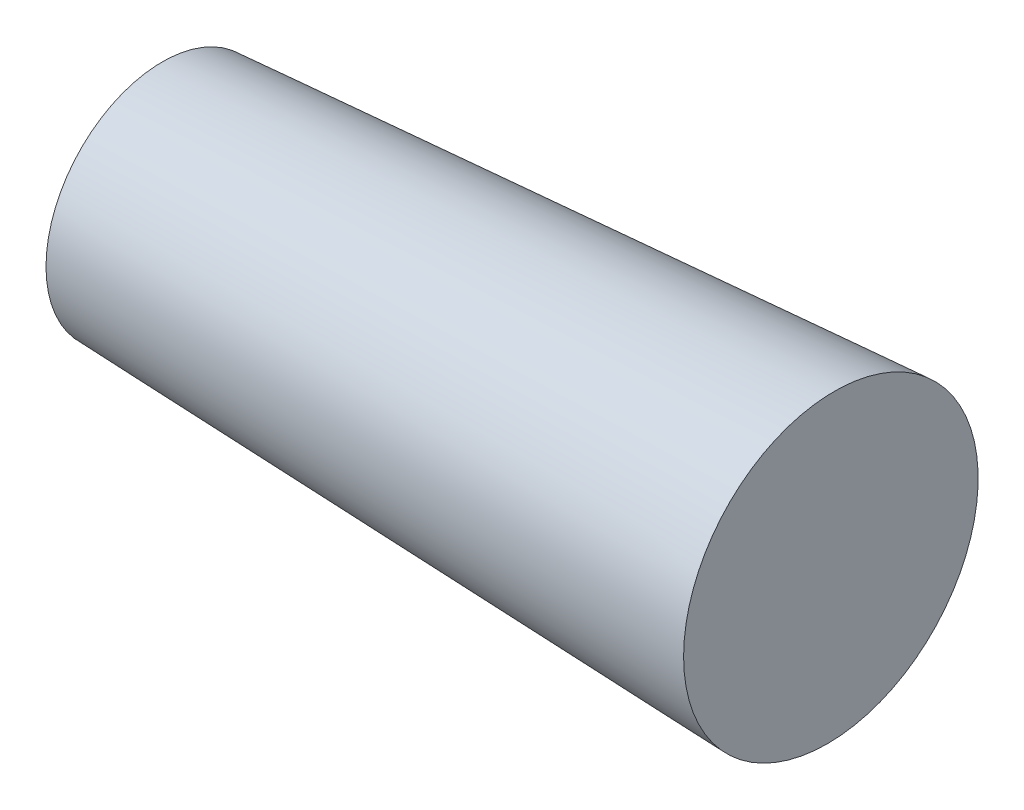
from build123d import *


with BuildPart() as part:
    # Esquisse1 → Base-R_volution (revolve)
    with BuildSketch(Plane(origin=(0, 0, 0), x_dir=(1, 0, 0), z_dir=(0, 1, 0)), mode=Mode.PRIVATE) as base_r_volution_sk:
        Polygon((-17.312106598, -0.407343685), (9.852981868, 0.231834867), (9.705963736, 6.480105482), (-17.425626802, 4.417264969), align=None)
    revolve(base_r_volution_sk.sketch.rotate(Axis((0, 0, 0), (0.9997232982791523, 0, -0.023522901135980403)), 180), axis=Axis((0, 0, 0), (0.9997232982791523, 0, -0.023522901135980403)))


solid = part.part
